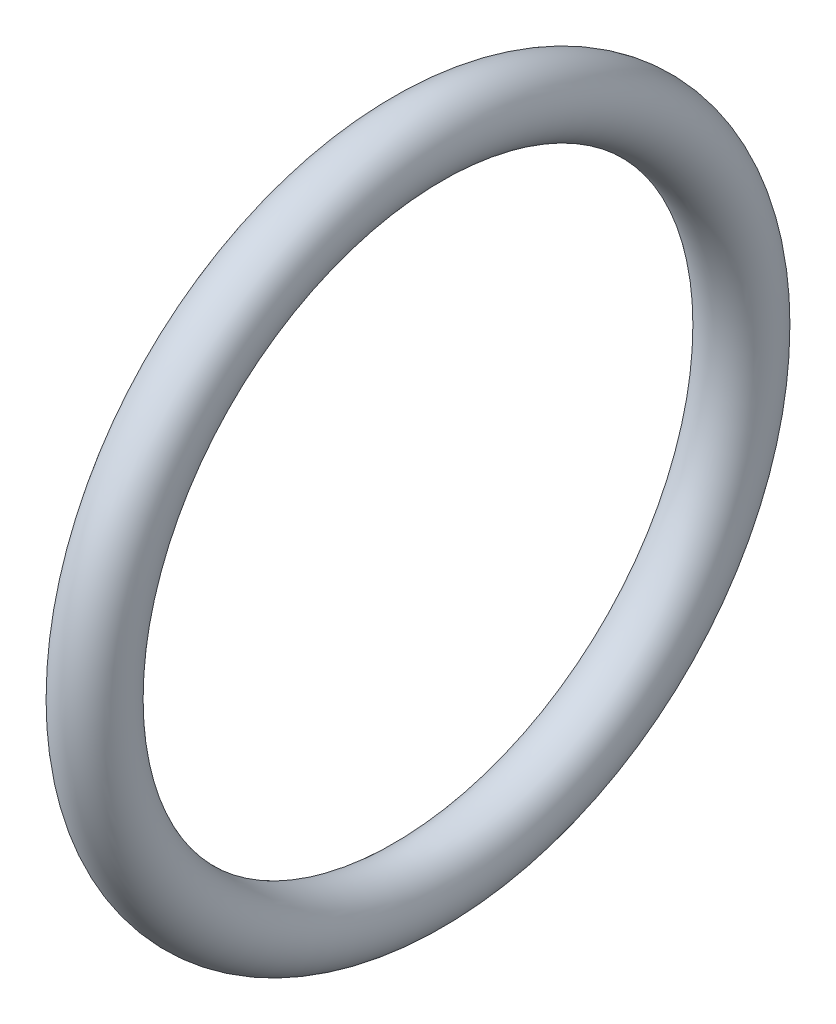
ISO-10303-21;
HEADER;
FILE_DESCRIPTION(('STEP AP214'),'2;1');
FILE_NAME('part.step','',(''),(''),'','','');
FILE_SCHEMA(('AUTOMOTIVE_DESIGN { 1 0 10303 214 1 1 1 1 }'));
ENDSEC;
DATA;
#1=APPLICATION_CONTEXT('core data for automotive mechanical design processes');
#2=APPLICATION_PROTOCOL_DEFINITION('international standard','automotive_design',2000,#1);
#3=PRODUCT_CONTEXT('',#1,'mechanical');
#4=PRODUCT('Part','Part','',(#3));
#5=PRODUCT_RELATED_PRODUCT_CATEGORY('part','',(#4));
#6=PRODUCT_DEFINITION_FORMATION('','',#4);
#7=PRODUCT_DEFINITION_CONTEXT('part definition',#1,'design');
#8=PRODUCT_DEFINITION('design','',#6,#7);
#9=PRODUCT_DEFINITION_SHAPE('','',#8);
#10=(LENGTH_UNIT() NAMED_UNIT(*) SI_UNIT(.MILLI.,.METRE.));
#11=(NAMED_UNIT(*) PLANE_ANGLE_UNIT() SI_UNIT($,.RADIAN.));
#12=(NAMED_UNIT(*) SI_UNIT($,.STERADIAN.) SOLID_ANGLE_UNIT());
#13=UNCERTAINTY_MEASURE_WITH_UNIT(LENGTH_MEASURE(1.E-05),#10,'distance_accuracy_value','');
#14=(GEOMETRIC_REPRESENTATION_CONTEXT(3) GLOBAL_UNCERTAINTY_ASSIGNED_CONTEXT((#13)) GLOBAL_UNIT_ASSIGNED_CONTEXT((#10,
#11,#12)) REPRESENTATION_CONTEXT('',''));
#15=CARTESIAN_POINT('',(0.,0.,0.));
#16=DIRECTION('',(0.,0.,1.));
#17=DIRECTION('',(1.,0.,0.));
#18=AXIS2_PLACEMENT_3D('',#15,#16,#17);
#19=CARTESIAN_POINT('',(-0.628156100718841,0.,0.));
#20=DIRECTION('',(-1.,0.,0.));
#21=DIRECTION('',(0.,0.,1.));
#22=AXIS2_PLACEMENT_3D('',#19,#20,#21);
#23=TOROIDAL_SURFACE('',#22,8.95,0.949999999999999);
#24=CARTESIAN_POINT('',(-0.628156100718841,0.,9.9));
#25=VERTEX_POINT('',#24);
#26=VERTEX_LOOP('',#25);
#27=FACE_BOUND('',#26,.T.);
#28=ADVANCED_FACE('F29',(#27),#23,.T.);
#29=CLOSED_SHELL('',(#28));
#30=MANIFOLD_SOLID_BREP('B2',#29);
#31=ADVANCED_BREP_SHAPE_REPRESENTATION('',(#18,#30),#14);
#32=SHAPE_DEFINITION_REPRESENTATION(#9,#31);
ENDSEC;
END-ISO-10303-21;
